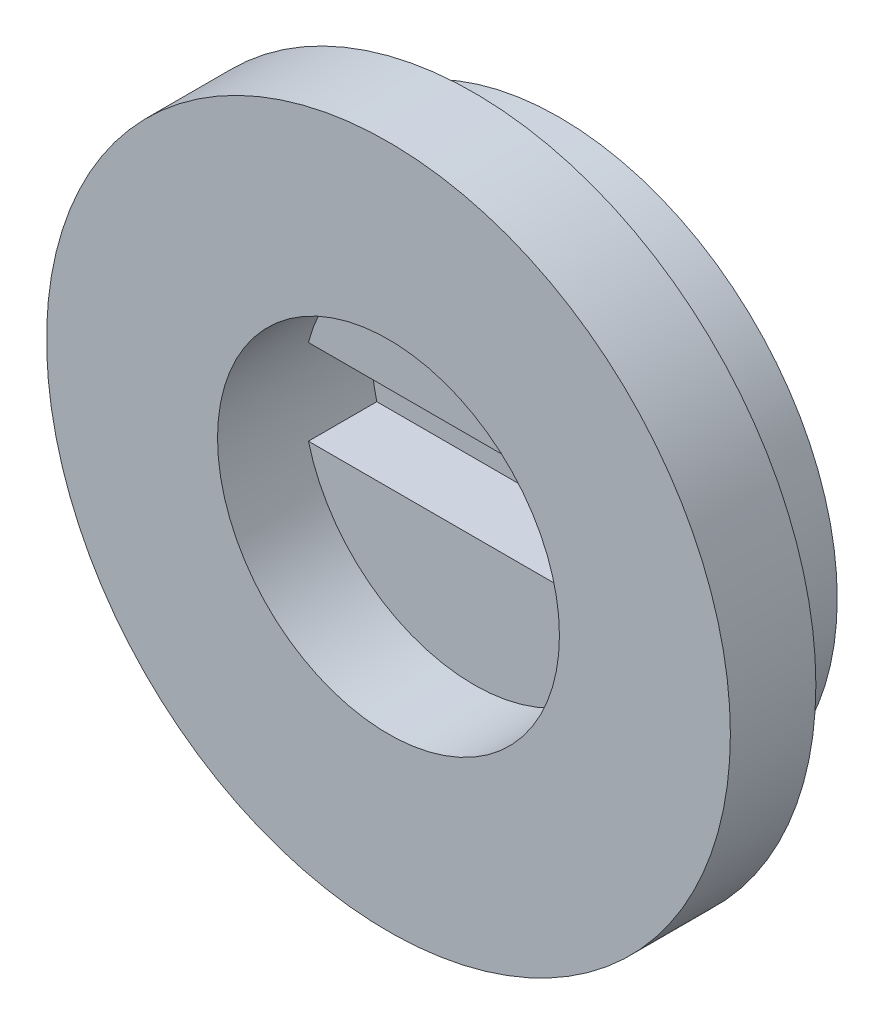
from build123d import *
from build123d.topology import SkipClean

# Parameters (mm, degrees)
ESQUISSE1_R             = 3.25
EXTRUSION1_DEPTH        = 1
ESQUISSE2_R             = 4
EXTRUSION2_DEPTH        = 1
ESQUISSE3_R             = 2
ENL_V_MAT_EXTRU_1_DEPTH = 1
ENL_V_MAT_EXTRU_2_DEPTH = 0.8


with BuildPart() as part:
    # Esquisse1 → Extrusion1 (new body)
    with BuildSketch(Plane.XY):
        with Locations((-13, 3.928237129)):
            Circle(ESQUISSE1_R)
    extrude(amount=-EXTRUSION1_DEPTH)

    # Esquisse2 → Extrusion2 (add)
    with BuildSketch(Plane.XY):
        with Locations((-13, 3.928237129)):
            Circle(ESQUISSE2_R)
    extrude(amount=EXTRUSION2_DEPTH)

    # Esquisse3 → Enl_v. mat.-Extru.1 (cut)
    with BuildSketch(Plane.XY.offset(1)):
        with Locations((-13, 3.928237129)):
            Circle(ESQUISSE3_R)
    extrude(amount=-ENL_V_MAT_EXTRU_1_DEPTH, mode=Mode.SUBTRACT)

    # Esquisse4 → Enl_v. mat.-Extru.2 (cut)
    with SkipClean():  # the faces are left unmerged after this step: merging them gives an invalid solid
        with BuildSketch(Plane.XY):
            with BuildLine():
                Line((-14.936491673, 4.428237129), (-11.063508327, 4.428237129))
                ThreePointArc((-11.063508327, 4.428237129), (-11, 3.928237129), (-11.063508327, 3.428237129))
                Line((-11.063508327, 3.428237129), (-14.936491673, 3.428237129))
                ThreePointArc((-14.936491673, 3.428237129), (-15, 3.928237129), (-14.936491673, 4.428237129))
            make_face()
        extrude(amount=-ENL_V_MAT_EXTRU_2_DEPTH, mode=Mode.SUBTRACT)


solid = part.part
